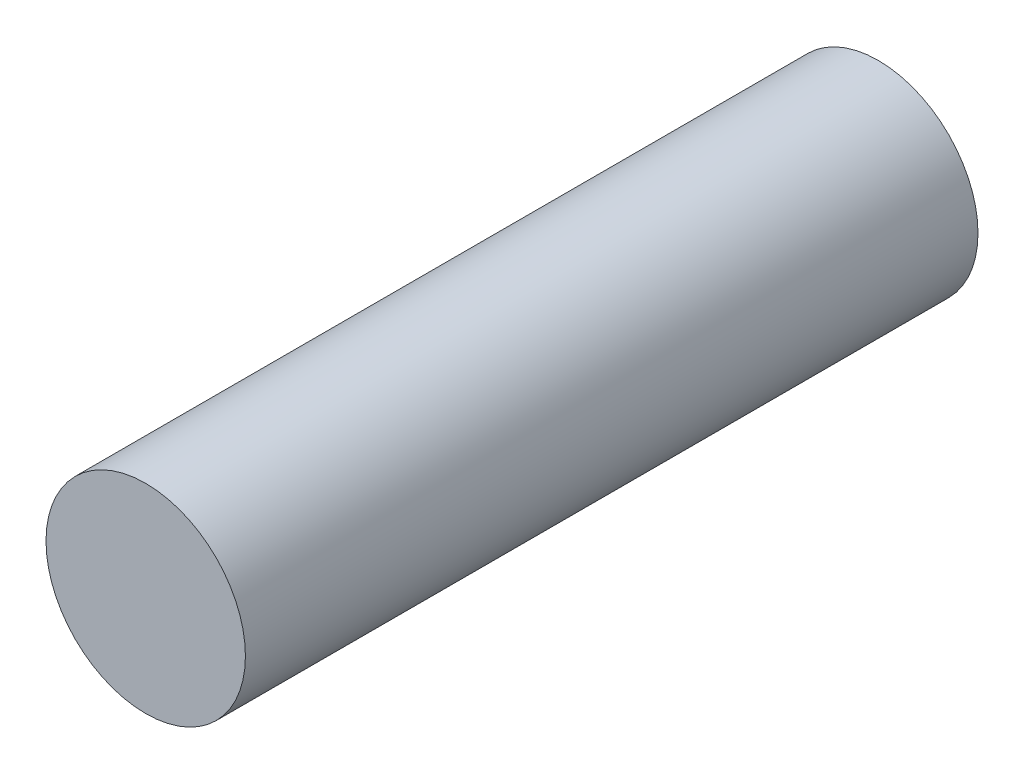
ISO-10303-21;
HEADER;
FILE_DESCRIPTION(('STEP AP214'),'2;1');
FILE_NAME('part.step','',(''),(''),'','','');
FILE_SCHEMA(('AUTOMOTIVE_DESIGN { 1 0 10303 214 1 1 1 1 }'));
ENDSEC;
DATA;
#1=APPLICATION_CONTEXT('core data for automotive mechanical design processes');
#2=APPLICATION_PROTOCOL_DEFINITION('international standard','automotive_design',2000,#1);
#3=PRODUCT_CONTEXT('',#1,'mechanical');
#4=PRODUCT('Part','Part','',(#3));
#5=PRODUCT_RELATED_PRODUCT_CATEGORY('part','',(#4));
#6=PRODUCT_DEFINITION_FORMATION('','',#4);
#7=PRODUCT_DEFINITION_CONTEXT('part definition',#1,'design');
#8=PRODUCT_DEFINITION('design','',#6,#7);
#9=PRODUCT_DEFINITION_SHAPE('','',#8);
#10=(LENGTH_UNIT() NAMED_UNIT(*) SI_UNIT(.MILLI.,.METRE.));
#11=(NAMED_UNIT(*) PLANE_ANGLE_UNIT() SI_UNIT($,.RADIAN.));
#12=(NAMED_UNIT(*) SI_UNIT($,.STERADIAN.) SOLID_ANGLE_UNIT());
#13=UNCERTAINTY_MEASURE_WITH_UNIT(LENGTH_MEASURE(1.E-05),#10,'distance_accuracy_value','');
#14=(GEOMETRIC_REPRESENTATION_CONTEXT(3) GLOBAL_UNCERTAINTY_ASSIGNED_CONTEXT((#13)) GLOBAL_UNIT_ASSIGNED_CONTEXT((#10,
#11,#12)) REPRESENTATION_CONTEXT('',''));
#15=CARTESIAN_POINT('',(0.,0.,0.));
#16=DIRECTION('',(0.,0.,1.));
#17=DIRECTION('',(1.,0.,0.));
#18=AXIS2_PLACEMENT_3D('',#15,#16,#17);
#19=CARTESIAN_POINT('',(0.,0.,18.));
#20=DIRECTION('',(0.,0.,-1.));
#21=DIRECTION('',(-1.,0.,0.));
#22=AXIS2_PLACEMENT_3D('',#19,#20,#21);
#23=CYLINDRICAL_SURFACE('',#22,2.45);
#24=CARTESIAN_POINT('',(0.,0.,18.));
#25=DIRECTION('',(0.,0.,1.));
#26=DIRECTION('',(1.,0.,0.));
#27=AXIS2_PLACEMENT_3D('',#24,#25,#26);
#28=CIRCLE('',#27,2.45);
#29=CARTESIAN_POINT('',(2.45,0.,18.));
#30=VERTEX_POINT('',#29);
#31=EDGE_CURVE('E10',#30,#30,#28,.T.);
#32=ORIENTED_EDGE('',*,*,#31,.F.);
#33=EDGE_LOOP('',(#32));
#34=FACE_BOUND('',#33,.T.);
#35=CARTESIAN_POINT('',(0.,0.,0.));
#36=DIRECTION('',(0.,0.,1.));
#37=DIRECTION('',(1.,0.,0.));
#38=AXIS2_PLACEMENT_3D('',#35,#36,#37);
#39=CIRCLE('',#38,2.45);
#40=CARTESIAN_POINT('',(2.45,0.,0.));
#41=VERTEX_POINT('',#40);
#42=EDGE_CURVE('E44',#41,#41,#39,.T.);
#43=ORIENTED_EDGE('',*,*,#42,.T.);
#44=EDGE_LOOP('',(#43));
#45=FACE_BOUND('',#44,.T.);
#46=ADVANCED_FACE('F41',(#34,#45),#23,.T.);
#47=CARTESIAN_POINT('',(0.,0.,18.));
#48=DIRECTION('',(0.,0.,1.));
#49=DIRECTION('',(1.,0.,0.));
#50=AXIS2_PLACEMENT_3D('',#47,#48,#49);
#51=PLANE('',#50);
#52=ORIENTED_EDGE('',*,*,#31,.T.);
#53=EDGE_LOOP('',(#52));
#54=FACE_BOUND('',#53,.T.);
#55=ADVANCED_FACE('F58',(#54),#51,.T.);
#56=CARTESIAN_POINT('',(0.,0.,0.));
#57=DIRECTION('',(0.,0.,1.));
#58=DIRECTION('',(1.,0.,0.));
#59=AXIS2_PLACEMENT_3D('',#56,#57,#58);
#60=PLANE('',#59);
#61=ORIENTED_EDGE('',*,*,#42,.F.);
#62=EDGE_LOOP('',(#61));
#63=FACE_BOUND('',#62,.T.);
#64=ADVANCED_FACE('F56',(#63),#60,.F.);
#65=CLOSED_SHELL('',(#46,#55,#64));
#66=MANIFOLD_SOLID_BREP('B2',#65);
#67=ADVANCED_BREP_SHAPE_REPRESENTATION('',(#18,#66),#14);
#68=SHAPE_DEFINITION_REPRESENTATION(#9,#67);
ENDSEC;
END-ISO-10303-21;
